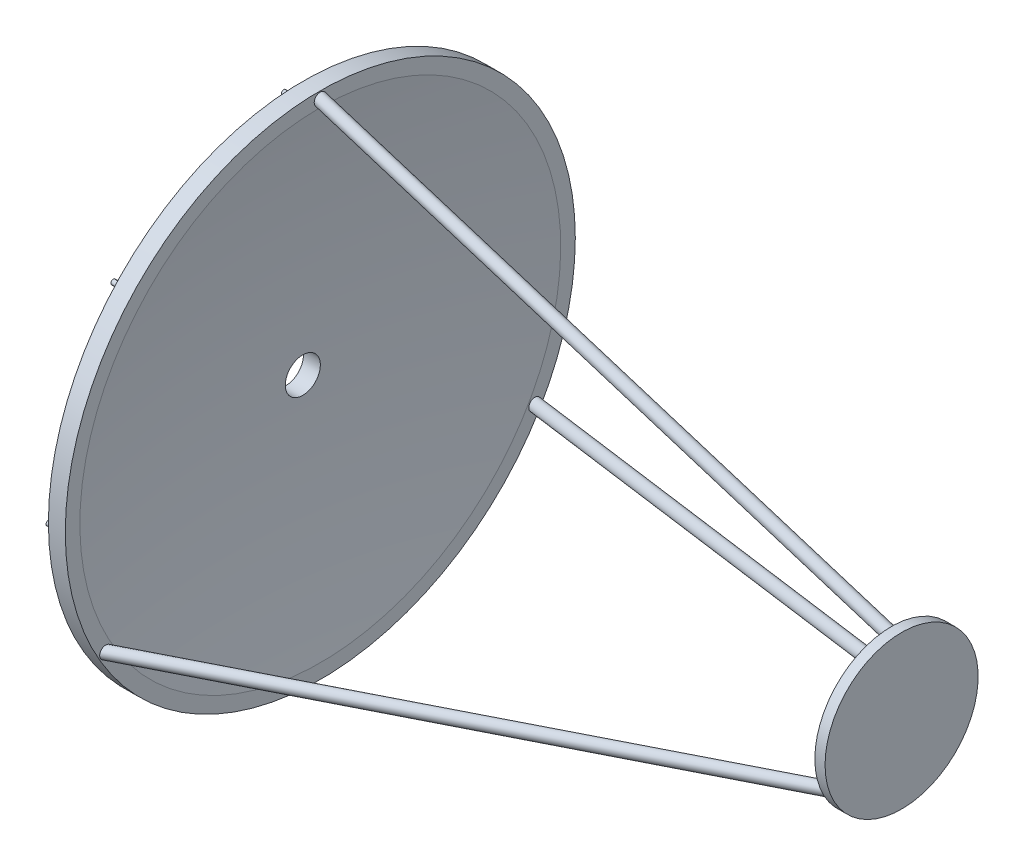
ISO-10303-21;
HEADER;
FILE_DESCRIPTION(('STEP AP214'),'2;1');
FILE_NAME('part.step','',(''),(''),'','','');
FILE_SCHEMA(('AUTOMOTIVE_DESIGN { 1 0 10303 214 1 1 1 1 }'));
ENDSEC;
DATA;
#1=APPLICATION_CONTEXT('core data for automotive mechanical design processes');
#2=APPLICATION_PROTOCOL_DEFINITION('international standard','automotive_design',2000,#1);
#3=PRODUCT_CONTEXT('',#1,'mechanical');
#4=PRODUCT('Part','Part','',(#3));
#5=PRODUCT_RELATED_PRODUCT_CATEGORY('part','',(#4));
#6=PRODUCT_DEFINITION_FORMATION('','',#4);
#7=PRODUCT_DEFINITION_CONTEXT('part definition',#1,'design');
#8=PRODUCT_DEFINITION('design','',#6,#7);
#9=PRODUCT_DEFINITION_SHAPE('','',#8);
#10=(LENGTH_UNIT() NAMED_UNIT(*) SI_UNIT(.MILLI.,.METRE.));
#11=(NAMED_UNIT(*) PLANE_ANGLE_UNIT() SI_UNIT($,.RADIAN.));
#12=(NAMED_UNIT(*) SI_UNIT($,.STERADIAN.) SOLID_ANGLE_UNIT());
#13=UNCERTAINTY_MEASURE_WITH_UNIT(LENGTH_MEASURE(1.E-05),#10,'distance_accuracy_value','');
#14=(GEOMETRIC_REPRESENTATION_CONTEXT(3) GLOBAL_UNCERTAINTY_ASSIGNED_CONTEXT((#13)) GLOBAL_UNIT_ASSIGNED_CONTEXT((#10,
#11,#12)) REPRESENTATION_CONTEXT('',''));
#15=CARTESIAN_POINT('',(0.,0.,0.));
#16=DIRECTION('',(0.,0.,1.));
#17=DIRECTION('',(1.,0.,0.));
#18=AXIS2_PLACEMENT_3D('',#15,#16,#17);
#19=CARTESIAN_POINT('',(464.23266125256,494.679567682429,-5.18085286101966E-13));
#20=DIRECTION('',(-1.,0.,0.));
#21=DIRECTION('',(0.,1.,0.));
#22=AXIS2_PLACEMENT_3D('',#19,#20,#21);
#23=SPHERICAL_SURFACE('',#22,374.);
#24=CARTESIAN_POINT('',(90.2537193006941,494.679567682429,-5.01866450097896E-13));
#25=DIRECTION('',(1.,0.,0.));
#26=DIRECTION('',(0.,0.,-1.));
#27=AXIS2_PLACEMENT_3D('',#24,#25,#26);
#28=CIRCLE('',#27,3.96875000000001);
#29=CARTESIAN_POINT('',(90.2537193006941,498.64831768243,-5.18085286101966E-13));
#30=VERTEX_POINT('',#29);
#31=EDGE_CURVE('E171',#30,#30,#28,.T.);
#32=CARTESIAN_POINT('',(94.2123446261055,494.679567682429,-5.18085286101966E-13));
#33=DIRECTION('',(-1.,0.,0.));
#34=DIRECTION('',(0.,0.,1.));
#35=AXIS2_PLACEMENT_3D('',#32,#33,#34);
#36=CIRCLE('',#35,54.4147524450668);
#37=CARTESIAN_POINT('',(94.2123446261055,549.094320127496,-5.18085286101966E-13));
#38=VERTEX_POINT('',#37);
#39=EDGE_CURVE('E105',#38,#38,#36,.T.);
#40=CARTESIAN_POINT('',(90.2537193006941,498.64831768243,-5.18085286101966E-13));
#41=CARTESIAN_POINT('',(90.25931690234,499.175785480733,-5.18085286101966E-13));
#42=CARTESIAN_POINT('',(90.2660304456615,499.703241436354,-5.18085286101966E-13));
#43=CARTESIAN_POINT('',(90.2816892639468,500.758120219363,-5.18085286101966E-13));
#44=CARTESIAN_POINT('',(90.2906345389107,501.28554304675,-5.18085286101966E-13));
#45=CARTESIAN_POINT('',(90.3107566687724,502.340346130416,-5.18085286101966E-13));
#46=CARTESIAN_POINT('',(90.3219335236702,502.867726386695,-5.18085286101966E-13));
#47=CARTESIAN_POINT('',(90.3465186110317,503.922434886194,-5.18085286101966E-13));
#48=CARTESIAN_POINT('',(90.3599268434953,504.449763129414,-5.18085286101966E-13));
#49=CARTESIAN_POINT('',(90.3889744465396,505.504358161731,-5.18085286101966E-13));
#50=CARTESIAN_POINT('',(90.4046138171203,506.031624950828,-5.18085286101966E-13));
#51=CARTESIAN_POINT('',(90.4381234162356,507.086087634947,-5.18085286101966E-13));
#52=CARTESIAN_POINT('',(90.4559936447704,507.613283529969,-5.18085286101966E-13));
#53=CARTESIAN_POINT('',(90.4939646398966,508.667594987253,-5.18085286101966E-13));
#54=CARTESIAN_POINT('',(90.5140654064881,509.194710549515,-5.18085286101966E-13));
#55=CARTESIAN_POINT('',(90.5564971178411,510.248851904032,-5.18085286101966E-13));
#56=CARTESIAN_POINT('',(90.5788280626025,510.775877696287,-5.18085286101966E-13));
#57=CARTESIAN_POINT('',(90.6257197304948,511.829830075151,-5.18085286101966E-13));
#58=CARTESIAN_POINT('',(90.6502804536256,512.35675666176,-5.18085286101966E-13));
#59=CARTESIAN_POINT('',(90.7016312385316,513.410501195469,-5.18085286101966E-13));
#60=CARTESIAN_POINT('',(90.7284213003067,513.937319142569,-5.18085286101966E-13));
#61=CARTESIAN_POINT('',(90.7842302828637,514.99083696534,-5.18085286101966E-13));
#62=CARTESIAN_POINT('',(90.8132492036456,515.517536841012,-5.18085286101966E-13));
#63=CARTESIAN_POINT('',(90.8735153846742,516.570809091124,-5.18085286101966E-13));
#64=CARTESIAN_POINT('',(90.9047626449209,517.097381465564,-5.18085286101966E-13));
#65=CARTESIAN_POINT('',(90.9694849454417,518.15038928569,-5.18085286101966E-13));
#66=CARTESIAN_POINT('',(91.0029599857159,518.676824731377,-5.18085286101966E-13));
#67=CARTESIAN_POINT('',(91.0721372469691,519.729549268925,-5.18085286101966E-13));
#68=CARTESIAN_POINT('',(91.1078394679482,520.255838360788,-5.18085286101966E-13));
#69=CARTESIAN_POINT('',(91.1814704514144,521.308260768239,-5.18085286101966E-13));
#70=CARTESIAN_POINT('',(91.2193992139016,521.834394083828,-5.18085286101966E-13));
#71=CARTESIAN_POINT('',(91.2974826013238,522.88649551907,-5.18085286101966E-13));
#72=CARTESIAN_POINT('',(91.3376372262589,523.412463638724,-5.18085286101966E-13));
#73=CARTESIAN_POINT('',(91.4201716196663,524.464225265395,-5.18085286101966E-13));
#74=CARTESIAN_POINT('',(91.4625513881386,524.990018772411,-5.18085286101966E-13));
#75=CARTESIAN_POINT('',(91.5495353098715,526.041421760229,-5.18085286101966E-13));
#76=CARTESIAN_POINT('',(91.5941394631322,526.56703124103,-5.18085286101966E-13));
#77=CARTESIAN_POINT('',(91.6855713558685,527.618056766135,-5.18085286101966E-13));
#78=CARTESIAN_POINT('',(91.7323990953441,528.143472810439,-5.18085286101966E-13));
#79=CARTESIAN_POINT('',(91.8282773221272,529.194102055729,-5.18085286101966E-13));
#80=CARTESIAN_POINT('',(91.8773278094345,529.719315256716,-5.18085286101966E-13));
#81=CARTESIAN_POINT('',(91.9776506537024,530.769529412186,-5.18085286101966E-13));
#82=CARTESIAN_POINT('',(92.0289230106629,531.294530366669,-5.18085286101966E-13));
#83=CARTESIAN_POINT('',(92.1336886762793,532.344310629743,-5.18085286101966E-13));
#84=CARTESIAN_POINT('',(92.1871819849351,532.869089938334,-5.18085286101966E-13));
#85=CARTESIAN_POINT('',(92.2963885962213,533.918417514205,-5.18085286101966E-13));
#86=CARTESIAN_POINT('',(92.3521018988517,534.442965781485,-5.18085286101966E-13));
#87=CARTESIAN_POINT('',(92.4657475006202,535.49182188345,-5.18085286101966E-13));
#88=CARTESIAN_POINT('',(92.5236797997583,536.016129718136,-5.18085286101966E-13));
#89=CARTESIAN_POINT('',(92.6417623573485,537.064495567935,-5.18085286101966E-13));
#90=CARTESIAN_POINT('',(92.7019126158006,537.588553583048,-5.18085286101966E-13));
#91=CARTESIAN_POINT('',(92.8244300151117,538.636410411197,-5.18085286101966E-13));
#92=CARTESIAN_POINT('',(92.8867971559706,539.160209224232,-5.18085286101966E-13));
#93=CARTESIAN_POINT('',(93.0137472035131,540.207538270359,-5.18085286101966E-13));
#94=CARTESIAN_POINT('',(93.0783301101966,540.73106850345,-5.18085286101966E-13));
#95=CARTESIAN_POINT('',(93.2097105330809,541.777851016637,-5.18085286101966E-13));
#96=CARTESIAN_POINT('',(93.2765080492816,542.301103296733,-5.18085286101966E-13));
#97=CARTESIAN_POINT('',(93.4123164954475,543.347320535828,-5.18085286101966E-13));
#98=CARTESIAN_POINT('',(93.4813274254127,543.870285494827,-5.18085286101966E-13));
#99=CARTESIAN_POINT('',(93.621561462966,544.915918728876,-5.18085286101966E-13));
#100=CARTESIAN_POINT('',(93.6927845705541,545.438587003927,-5.18085286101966E-13));
#101=CARTESIAN_POINT('',(93.8374416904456,546.483617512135,-5.18085286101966E-13));
#102=CARTESIAN_POINT('',(93.910875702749,547.005979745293,-5.18085286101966E-13));
#103=CARTESIAN_POINT('',(94.059953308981,548.050388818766,-5.18085286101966E-13));
#104=CARTESIAN_POINT('',(94.1355969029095,548.57243565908,-5.18085286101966E-13));
#105=CARTESIAN_POINT('',(94.2123446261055,549.094320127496,-5.18085286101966E-13));
#106=B_SPLINE_CURVE_WITH_KNOTS('',3,(#40,#41,#42,#43,#44,#45,#46,#47,#48,#49,#50,#51,#52,#53,
#54,#55,#56,#57,#58,#59,#60,#61,#62,#63,#64,#65,#66,#67,#68,#69,#70,#71,#72,#73,#74,#75,#76,#77,
#78,#79,#80,#81,#82,#83,#84,#85,#86,#87,#88,#89,#90,#91,#92,#93,#94,#95,#96,#97,#98,#99,#100,
#101,#102,#103,#104,#105),.UNSPECIFIED.,.F.,.F.,(4,2,2,2,2,2,2,2,2,2,2,2,2,2,2,2,2,2,2,2,2,2,2,
2,2,2,2,2,2,2,2,2,4),(0.,1.58249131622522,3.16498263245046,4.74747394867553,6.32996526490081,
7.91245658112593,9.49494789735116,11.0774392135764,12.6599305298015,14.2424218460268,
15.824913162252,17.4074044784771,18.9898957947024,20.5723871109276,22.1548784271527,
23.7373697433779,25.3198610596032,26.9023523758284,28.4848436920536,30.0673350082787,
31.6498263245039,33.2323176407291,34.8148089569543,36.3973002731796,37.9797915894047,
39.5622829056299,41.1447742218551,42.7272655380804,44.3097568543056,45.8922481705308,
47.4747394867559,49.0572308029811,50.6397221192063),.UNSPECIFIED.);
#107=EDGE_CURVE('BSEAM47',#30,#38,#106,.T.);
#108=ORIENTED_EDGE('',*,*,#31,.F.);
#109=ORIENTED_EDGE('',*,*,#39,.F.);
#110=ORIENTED_EDGE('',*,*,#107,.T.);
#111=ORIENTED_EDGE('',*,*,#107,.F.);
#112=EDGE_LOOP('',(#108,#110,#109,#111));
#113=FACE_BOUND('',#112,.T.);
#114=ADVANCED_FACE('F47',(#113),#23,.F.);
#115=CARTESIAN_POINT('',(460.409347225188,494.679567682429,-5.18085286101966E-13));
#116=DIRECTION('',(-1.,0.,0.));
#117=DIRECTION('',(0.,1.,0.));
#118=AXIS2_PLACEMENT_3D('',#115,#116,#117);
#119=SPHERICAL_SURFACE('',#118,374.);
#120=CARTESIAN_POINT('',(86.4304052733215,494.679567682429,-5.01866450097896E-13));
#121=DIRECTION('',(1.,0.,0.));
#122=DIRECTION('',(0.,0.,-1.));
#123=AXIS2_PLACEMENT_3D('',#120,#121,#122);
#124=CIRCLE('',#123,3.96875000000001);
#125=CARTESIAN_POINT('',(86.4304052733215,498.64831768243,-5.18085286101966E-13));
#126=VERTEX_POINT('',#125);
#127=EDGE_CURVE('E51',#126,#126,#124,.T.);
#128=CARTESIAN_POINT('',(90.3890305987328,494.679567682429,-5.18085286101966E-13));
#129=DIRECTION('',(-1.,0.,0.));
#130=DIRECTION('',(0.,0.,1.));
#131=AXIS2_PLACEMENT_3D('',#128,#129,#130);
#132=CIRCLE('',#131,54.4147524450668);
#133=CARTESIAN_POINT('',(90.3890305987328,549.094320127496,-5.18085286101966E-13));
#134=VERTEX_POINT('',#133);
#135=EDGE_CURVE('E121',#134,#134,#132,.T.);
#136=CARTESIAN_POINT('',(86.4304052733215,498.64831768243,-5.18085286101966E-13));
#137=CARTESIAN_POINT('',(86.4360028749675,499.175785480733,-5.18085286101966E-13));
#138=CARTESIAN_POINT('',(86.4427164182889,499.703241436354,-5.18085286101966E-13));
#139=CARTESIAN_POINT('',(86.4583752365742,500.758120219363,-5.18085286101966E-13));
#140=CARTESIAN_POINT('',(86.4673205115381,501.285543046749,-5.18085286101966E-13));
#141=CARTESIAN_POINT('',(86.4874426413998,502.340346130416,-5.18085286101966E-13));
#142=CARTESIAN_POINT('',(86.4986194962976,502.867726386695,-5.18085286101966E-13));
#143=CARTESIAN_POINT('',(86.5232045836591,503.922434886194,-5.18085286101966E-13));
#144=CARTESIAN_POINT('',(86.5366128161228,504.449763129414,-5.18085286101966E-13));
#145=CARTESIAN_POINT('',(86.565660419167,505.504358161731,-5.18085286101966E-13));
#146=CARTESIAN_POINT('',(86.5812997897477,506.031624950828,-5.18085286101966E-13));
#147=CARTESIAN_POINT('',(86.614809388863,507.086087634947,-5.18085286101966E-13));
#148=CARTESIAN_POINT('',(86.6326796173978,507.613283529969,-5.18085286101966E-13));
#149=CARTESIAN_POINT('',(86.670650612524,508.667594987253,-5.18085286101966E-13));
#150=CARTESIAN_POINT('',(86.6907513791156,509.194710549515,-5.18085286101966E-13));
#151=CARTESIAN_POINT('',(86.7331830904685,510.248851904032,-5.18085286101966E-13));
#152=CARTESIAN_POINT('',(86.7555140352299,510.775877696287,-5.18085286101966E-13));
#153=CARTESIAN_POINT('',(86.8024057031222,511.829830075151,-5.18085286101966E-13));
#154=CARTESIAN_POINT('',(86.826966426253,512.35675666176,-5.18085286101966E-13));
#155=CARTESIAN_POINT('',(86.878317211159,513.410501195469,-5.18085286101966E-13));
#156=CARTESIAN_POINT('',(86.9051072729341,513.937319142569,-5.18085286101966E-13));
#157=CARTESIAN_POINT('',(86.9609162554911,514.99083696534,-5.18085286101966E-13));
#158=CARTESIAN_POINT('',(86.989935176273,515.517536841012,-5.18085286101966E-13));
#159=CARTESIAN_POINT('',(87.0502013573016,516.570809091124,-5.18085286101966E-13));
#160=CARTESIAN_POINT('',(87.0814486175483,517.097381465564,-5.18085286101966E-13));
#161=CARTESIAN_POINT('',(87.1461709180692,518.15038928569,-5.18085286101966E-13));
#162=CARTESIAN_POINT('',(87.1796459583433,518.676824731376,-5.18085286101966E-13));
#163=CARTESIAN_POINT('',(87.2488232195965,519.729549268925,-5.18085286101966E-13));
#164=CARTESIAN_POINT('',(87.2845254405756,520.255838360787,-5.18085286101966E-13));
#165=CARTESIAN_POINT('',(87.3581564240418,521.308260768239,-5.18085286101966E-13));
#166=CARTESIAN_POINT('',(87.3960851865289,521.834394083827,-5.18085286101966E-13));
#167=CARTESIAN_POINT('',(87.4741685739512,522.88649551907,-5.18085286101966E-13));
#168=CARTESIAN_POINT('',(87.5143231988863,523.412463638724,-5.18085286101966E-13));
#169=CARTESIAN_POINT('',(87.5968575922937,524.464225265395,-5.18085286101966E-13));
#170=CARTESIAN_POINT('',(87.6392373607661,524.990018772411,-5.18085286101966E-13));
#171=CARTESIAN_POINT('',(87.726221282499,526.041421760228,-5.18085286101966E-13));
#172=CARTESIAN_POINT('',(87.7708254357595,526.56703124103,-5.18085286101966E-13));
#173=CARTESIAN_POINT('',(87.8622573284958,527.618056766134,-5.18085286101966E-13));
#174=CARTESIAN_POINT('',(87.9090850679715,528.143472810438,-5.18085286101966E-13));
#175=CARTESIAN_POINT('',(88.0049632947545,529.194102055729,-5.18085286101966E-13));
#176=CARTESIAN_POINT('',(88.0540137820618,529.719315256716,-5.18085286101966E-13));
#177=CARTESIAN_POINT('',(88.1543366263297,530.769529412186,-5.18085286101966E-13));
#178=CARTESIAN_POINT('',(88.2056089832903,531.294530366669,-5.18085286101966E-13));
#179=CARTESIAN_POINT('',(88.3103746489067,532.344310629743,-5.18085286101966E-13));
#180=CARTESIAN_POINT('',(88.3638679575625,532.869089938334,-5.18085286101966E-13));
#181=CARTESIAN_POINT('',(88.4730745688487,533.918417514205,-5.18085286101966E-13));
#182=CARTESIAN_POINT('',(88.5287878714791,534.442965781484,-5.18085286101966E-13));
#183=CARTESIAN_POINT('',(88.6424334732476,535.49182188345,-5.18085286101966E-13));
#184=CARTESIAN_POINT('',(88.7003657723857,536.016129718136,-5.18085286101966E-13));
#185=CARTESIAN_POINT('',(88.8184483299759,537.064495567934,-5.18085286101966E-13));
#186=CARTESIAN_POINT('',(88.8785985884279,537.588553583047,-5.18085286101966E-13));
#187=CARTESIAN_POINT('',(89.001115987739,538.636410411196,-5.18085286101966E-13));
#188=CARTESIAN_POINT('',(89.063483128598,539.160209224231,-5.18085286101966E-13));
#189=CARTESIAN_POINT('',(89.1904331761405,540.207538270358,-5.18085286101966E-13));
#190=CARTESIAN_POINT('',(89.255016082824,540.731068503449,-5.18085286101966E-13));
#191=CARTESIAN_POINT('',(89.3863965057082,541.777851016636,-5.18085286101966E-13));
#192=CARTESIAN_POINT('',(89.4531940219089,542.301103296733,-5.18085286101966E-13));
#193=CARTESIAN_POINT('',(89.5890024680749,543.347320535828,-5.18085286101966E-13));
#194=CARTESIAN_POINT('',(89.6580133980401,543.870285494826,-5.18085286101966E-13));
#195=CARTESIAN_POINT('',(89.7982474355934,544.915918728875,-5.18085286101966E-13));
#196=CARTESIAN_POINT('',(89.8694705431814,545.438587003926,-5.18085286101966E-13));
#197=CARTESIAN_POINT('',(90.0141276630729,546.483617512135,-5.18085286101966E-13));
#198=CARTESIAN_POINT('',(90.0875616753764,547.005979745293,-5.18085286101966E-13));
#199=CARTESIAN_POINT('',(90.2366392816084,548.050388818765,-5.18085286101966E-13));
#200=CARTESIAN_POINT('',(90.3122828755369,548.572435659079,-5.18085286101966E-13));
#201=CARTESIAN_POINT('',(90.3890305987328,549.094320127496,-5.18085286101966E-13));
#202=B_SPLINE_CURVE_WITH_KNOTS('',3,(#136,#137,#138,#139,#140,#141,#142,#143,#144,#145,#146,
#147,#148,#149,#150,#151,#152,#153,#154,#155,#156,#157,#158,#159,#160,#161,#162,#163,#164,#165,
#166,#167,#168,#169,#170,#171,#172,#173,#174,#175,#176,#177,#178,#179,#180,#181,#182,#183,#184,
#185,#186,#187,#188,#189,#190,#191,#192,#193,#194,#195,#196,#197,#198,#199,#200,#201),
.UNSPECIFIED.,.F.,.F.,(4,2,2,2,2,2,2,2,2,2,2,2,2,2,2,2,2,2,2,2,2,2,2,2,2,2,2,2,2,2,2,2,4),(0.,
1.58249131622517,3.1649826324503,4.74747394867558,6.32996526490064,7.91245658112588,
9.49494789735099,11.0774392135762,12.6599305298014,14.2424218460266,15.8249131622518,
17.4074044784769,18.9898957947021,20.5723871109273,22.1548784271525,23.7373697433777,
25.3198610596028,26.902352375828,28.4848436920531,30.0673350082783,31.6498263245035,
33.2323176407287,34.8148089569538,36.3973002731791,37.9797915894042,39.5622829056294,
41.1447742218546,42.7272655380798,44.309756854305,45.8922481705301,47.4747394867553,
49.0572308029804,50.6397221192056),.UNSPECIFIED.);
#203=EDGE_CURVE('BSEAM180',#126,#134,#202,.T.);
#204=ORIENTED_EDGE('',*,*,#127,.T.);
#205=ORIENTED_EDGE('',*,*,#135,.T.);
#206=ORIENTED_EDGE('',*,*,#203,.T.);
#207=ORIENTED_EDGE('',*,*,#203,.F.);
#208=EDGE_LOOP('',(#204,#206,#205,#207));
#209=FACE_BOUND('',#208,.T.);
#210=ADVANCED_FACE('F180',(#209),#119,.T.);
#211=CARTESIAN_POINT('',(90.3890305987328,494.679567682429,-5.18085286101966E-13));
#212=DIRECTION('',(-1.,0.,0.));
#213=DIRECTION('',(0.,0.,1.));
#214=AXIS2_PLACEMENT_3D('',#211,#212,#213);
#215=CYLINDRICAL_SURFACE('',#214,17.3248173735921);
#216=CARTESIAN_POINT('',(223.459602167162,494.679567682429,-5.18085286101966E-13));
#217=DIRECTION('',(-1.,0.,0.));
#218=DIRECTION('',(0.,0.,1.));
#219=AXIS2_PLACEMENT_3D('',#216,#217,#218);
#220=CIRCLE('',#219,17.3248173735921);
#221=CARTESIAN_POINT('',(223.459602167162,494.679567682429,17.3248173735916));
#222=VERTEX_POINT('',#221);
#223=EDGE_CURVE('E88',#222,#222,#220,.T.);
#224=ORIENTED_EDGE('',*,*,#223,.F.);
#225=EDGE_LOOP('',(#224));
#226=FACE_BOUND('',#225,.T.);
#227=CARTESIAN_POINT('',(225.770787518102,494.679567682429,-5.18085286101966E-13));
#228=DIRECTION('',(-1.,0.,0.));
#229=DIRECTION('',(0.,0.,1.));
#230=AXIS2_PLACEMENT_3D('',#227,#228,#229);
#231=CIRCLE('',#230,17.3248173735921);
#232=CARTESIAN_POINT('',(225.770787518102,494.679567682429,17.3248173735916));
#233=VERTEX_POINT('',#232);
#234=EDGE_CURVE('E97',#233,#233,#231,.T.);
#235=ORIENTED_EDGE('',*,*,#234,.T.);
#236=EDGE_LOOP('',(#235));
#237=FACE_BOUND('',#236,.T.);
#238=ADVANCED_FACE('F49',(#226,#237),#215,.T.);
#239=CARTESIAN_POINT('',(223.459602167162,440.264815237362,-5.18085286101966E-13));
#240=DIRECTION('',(1.,0.,0.));
#241=DIRECTION('',(0.,0.,-1.));
#242=AXIS2_PLACEMENT_3D('',#239,#240,#241);
#243=PLANE('',#242);
#244=CARTESIAN_POINT('',(223.459602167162,486.842158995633,13.574790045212));
#245=DIRECTION('',(-1.,0.,0.));
#246=DIRECTION('',(0.,-0.866025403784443,-0.499999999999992));
#247=AXIS2_PLACEMENT_3D('',#244,#245,#246);
#248=CIRCLE('',#247,1.375);
#249=CARTESIAN_POINT('',(223.459602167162,485.65137406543,12.887290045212));
#250=VERTEX_POINT('',#249);
#251=EDGE_CURVE('E87',#250,#250,#248,.T.);
#252=ORIENTED_EDGE('',*,*,#251,.F.);
#253=EDGE_LOOP('',(#252));
#254=FACE_BOUND('',#253,.T.);
#255=CARTESIAN_POINT('',(223.459602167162,486.842158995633,-13.5747900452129));
#256=DIRECTION('',(-1.,0.,0.));
#257=DIRECTION('',(0.,0.866025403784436,-0.500000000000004));
#258=AXIS2_PLACEMENT_3D('',#255,#256,#257);
#259=CIRCLE('',#258,1.375);
#260=CARTESIAN_POINT('',(223.459602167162,488.032943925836,-14.2622900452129));
#261=VERTEX_POINT('',#260);
#262=EDGE_CURVE('E109',#261,#261,#259,.T.);
#263=ORIENTED_EDGE('',*,*,#262,.F.);
#264=EDGE_LOOP('',(#263));
#265=FACE_BOUND('',#264,.T.);
#266=CARTESIAN_POINT('',(223.459602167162,510.354385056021,-5.18085286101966E-13));
#267=DIRECTION('',(-1.,0.,0.));
#268=DIRECTION('',(0.,0.,1.));
#269=AXIS2_PLACEMENT_3D('',#266,#267,#268);
#270=CIRCLE('',#269,1.375);
#271=CARTESIAN_POINT('',(223.459602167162,510.354385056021,1.37499999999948));
#272=VERTEX_POINT('',#271);
#273=EDGE_CURVE('E92',#272,#272,#270,.T.);
#274=ORIENTED_EDGE('',*,*,#273,.F.);
#275=EDGE_LOOP('',(#274));
#276=FACE_BOUND('',#275,.T.);
#277=CARTESIAN_POINT('',(223.459602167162,494.679567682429,-5.18085286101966E-13));
#278=DIRECTION('',(-1.,0.,0.));
#279=DIRECTION('',(0.,0.,1.));
#280=AXIS2_PLACEMENT_3D('',#277,#278,#279);
#281=CIRCLE('',#280,14.0248173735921);
#282=CARTESIAN_POINT('',(223.459602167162,494.679567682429,14.0248173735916));
#283=VERTEX_POINT('',#282);
#284=EDGE_CURVE('E93',#283,#283,#281,.T.);
#285=ORIENTED_EDGE('',*,*,#284,.F.);
#286=EDGE_LOOP('',(#285));
#287=FACE_BOUND('',#286,.T.);
#288=ORIENTED_EDGE('',*,*,#223,.T.);
#289=EDGE_LOOP('',(#288));
#290=FACE_BOUND('',#289,.T.);
#291=ADVANCED_FACE('F222',(#254,#265,#276,#287,#290),#243,.F.);
#292=CARTESIAN_POINT('',(314.789030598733,494.679567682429,-5.18085286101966E-13));
#293=DIRECTION('',(-1.,0.,0.));
#294=DIRECTION('',(0.,1.,0.));
#295=AXIS2_PLACEMENT_3D('',#292,#293,#294);
#296=SPHERICAL_SURFACE('',#295,92.4);
#297=ORIENTED_EDGE('',*,*,#284,.T.);
#298=EDGE_LOOP('',(#297));
#299=FACE_BOUND('',#298,.T.);
#300=ADVANCED_FACE('F219',(#299),#296,.T.);
#301=CARTESIAN_POINT('',(225.770787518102,440.264815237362,-5.18085286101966E-13));
#302=DIRECTION('',(-1.,0.,0.));
#303=DIRECTION('',(0.,0.,1.));
#304=AXIS2_PLACEMENT_3D('',#301,#302,#303);
#305=PLANE('',#304);
#306=ORIENTED_EDGE('',*,*,#234,.F.);
#307=EDGE_LOOP('',(#306));
#308=FACE_BOUND('',#307,.T.);
#309=ADVANCED_FACE('F210',(#308),#305,.F.);
#310=CARTESIAN_POINT('',(223.459602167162,510.354385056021,1.37499999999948));
#311=CARTESIAN_POINT('',(94.2123446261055,550.744320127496,1.37499999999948));
#312=CARTESIAN_POINT('',(223.459602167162,513.104385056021,1.37499999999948));
#313=CARTESIAN_POINT('',(94.2123446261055,553.494320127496,1.37499999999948));
#314=CARTESIAN_POINT('',(223.459602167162,513.104385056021,-1.37500000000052));
#315=CARTESIAN_POINT('',(94.2123446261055,553.494320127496,-1.37500000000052));
#316=CARTESIAN_POINT('',(223.459602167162,510.354385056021,-1.37500000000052));
#317=CARTESIAN_POINT('',(94.2123446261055,550.744320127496,-1.37500000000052));
#318=CARTESIAN_POINT('',(223.459602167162,507.604385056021,-1.37500000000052));
#319=CARTESIAN_POINT('',(94.2123446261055,547.994320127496,-1.37500000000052));
#320=CARTESIAN_POINT('',(223.459602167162,507.604385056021,1.37499999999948));
#321=CARTESIAN_POINT('',(94.2123446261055,547.994320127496,1.37499999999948));
#322=CARTESIAN_POINT('',(223.459602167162,510.354385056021,1.37499999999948));
#323=CARTESIAN_POINT('',(94.2123446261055,550.744320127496,1.37499999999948));
#324=(BOUNDED_SURFACE() B_SPLINE_SURFACE(3,1,((#310,#311),(#312,#313),(#314,#315),(#316,#317),
(#318,#319),(#320,#321),(#322,#323)),.UNSPECIFIED.,.T.,.F.,.F.) B_SPLINE_SURFACE_WITH_KNOTS((4,
3,4),(2,2),(0.,0.5,1.),(0.,1.),
.UNSPECIFIED.) GEOMETRIC_REPRESENTATION_ITEM() RATIONAL_B_SPLINE_SURFACE(((1.,1.),
(0.333333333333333,0.333333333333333),(0.333333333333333,0.333333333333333),(1.,1.),
(0.333333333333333,0.333333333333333),(0.333333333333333,0.333333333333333),(1.,1.))) REPRESENTATION_ITEM('') SURFACE());
#325=CARTESIAN_POINT('',(94.2123446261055,550.744320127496,-5.18085286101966E-13));
#326=DIRECTION('',(-1.,0.,0.));
#327=DIRECTION('',(0.,0.,1.));
#328=AXIS2_PLACEMENT_3D('',#325,#326,#327);
#329=CIRCLE('',#328,1.375);
#330=CARTESIAN_POINT('',(94.2123446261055,550.744320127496,1.37499999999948));
#331=VERTEX_POINT('',#330);
#332=EDGE_CURVE('E101',#331,#331,#329,.T.);
#333=CARTESIAN_POINT('',(94.2123446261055,550.744320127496,1.37499999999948));
#334=CARTESIAN_POINT('',(95.5586702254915,550.323591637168,1.37499999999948));
#335=CARTESIAN_POINT('',(96.9049958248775,549.90286314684,1.37499999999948));
#336=CARTESIAN_POINT('',(99.5976470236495,549.061406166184,1.37499999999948));
#337=CARTESIAN_POINT('',(100.943972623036,548.640677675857,1.37499999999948));
#338=CARTESIAN_POINT('',(103.636623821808,547.799220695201,1.37499999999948));
#339=CARTESIAN_POINT('',(104.982949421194,547.378492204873,1.37499999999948));
#340=CARTESIAN_POINT('',(107.675600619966,546.537035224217,1.37499999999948));
#341=CARTESIAN_POINT('',(109.021926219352,546.116306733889,1.37499999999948));
#342=CARTESIAN_POINT('',(111.714577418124,545.274849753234,1.37499999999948));
#343=CARTESIAN_POINT('',(113.06090301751,544.854121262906,1.37499999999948));
#344=CARTESIAN_POINT('',(115.753554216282,544.01266428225,1.37499999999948));
#345=CARTESIAN_POINT('',(117.099879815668,543.591935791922,1.37499999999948));
#346=CARTESIAN_POINT('',(119.79253101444,542.750478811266,1.37499999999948));
#347=CARTESIAN_POINT('',(121.138856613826,542.329750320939,1.37499999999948));
#348=CARTESIAN_POINT('',(123.831507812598,541.488293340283,1.37499999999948));
#349=CARTESIAN_POINT('',(125.177833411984,541.067564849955,1.37499999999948));
#350=CARTESIAN_POINT('',(127.870484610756,540.226107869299,1.37499999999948));
#351=CARTESIAN_POINT('',(129.216810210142,539.805379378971,1.37499999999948));
#352=CARTESIAN_POINT('',(131.909461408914,538.963922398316,1.37499999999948));
#353=CARTESIAN_POINT('',(133.2557870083,538.543193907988,1.37499999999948));
#354=CARTESIAN_POINT('',(135.948438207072,537.701736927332,1.37499999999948));
#355=CARTESIAN_POINT('',(137.294763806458,537.281008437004,1.37499999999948));
#356=CARTESIAN_POINT('',(139.98741500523,536.439551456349,1.37499999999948));
#357=CARTESIAN_POINT('',(141.333740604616,536.018822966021,1.37499999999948));
#358=CARTESIAN_POINT('',(144.026391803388,535.177365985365,1.37499999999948));
#359=CARTESIAN_POINT('',(145.372717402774,534.756637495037,1.37499999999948));
#360=CARTESIAN_POINT('',(148.065368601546,533.915180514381,1.37499999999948));
#361=CARTESIAN_POINT('',(149.411694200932,533.494452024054,1.37499999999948));
#362=CARTESIAN_POINT('',(152.104345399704,532.652995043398,1.37499999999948));
#363=CARTESIAN_POINT('',(153.45067099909,532.23226655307,1.37499999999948));
#364=CARTESIAN_POINT('',(156.143322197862,531.390809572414,1.37499999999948));
#365=CARTESIAN_POINT('',(157.489647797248,530.970081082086,1.37499999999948));
#366=CARTESIAN_POINT('',(160.18229899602,530.12862410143,1.37499999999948));
#367=CARTESIAN_POINT('',(161.528624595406,529.707895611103,1.37499999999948));
#368=CARTESIAN_POINT('',(164.221275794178,528.866438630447,1.37499999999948));
#369=CARTESIAN_POINT('',(165.567601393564,528.445710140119,1.37499999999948));
#370=CARTESIAN_POINT('',(168.260252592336,527.604253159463,1.37499999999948));
#371=CARTESIAN_POINT('',(169.606578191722,527.183524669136,1.37499999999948));
#372=CARTESIAN_POINT('',(172.299229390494,526.34206768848,1.37499999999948));
#373=CARTESIAN_POINT('',(173.64555498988,525.921339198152,1.37499999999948));
#374=CARTESIAN_POINT('',(176.338206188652,525.079882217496,1.37499999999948));
#375=CARTESIAN_POINT('',(177.684531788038,524.659153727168,1.37499999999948));
#376=CARTESIAN_POINT('',(180.37718298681,523.817696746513,1.37499999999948));
#377=CARTESIAN_POINT('',(181.723508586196,523.396968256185,1.37499999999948));
#378=CARTESIAN_POINT('',(184.416159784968,522.555511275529,1.37499999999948));
#379=CARTESIAN_POINT('',(185.762485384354,522.134782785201,1.37499999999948));
#380=CARTESIAN_POINT('',(188.455136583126,521.293325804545,1.37499999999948));
#381=CARTESIAN_POINT('',(189.801462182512,520.872597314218,1.37499999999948));
#382=CARTESIAN_POINT('',(192.494113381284,520.031140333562,1.37499999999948));
#383=CARTESIAN_POINT('',(193.84043898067,519.610411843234,1.37499999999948));
#384=CARTESIAN_POINT('',(196.533090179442,518.768954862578,1.37499999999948));
#385=CARTESIAN_POINT('',(197.879415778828,518.348226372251,1.37499999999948));
#386=CARTESIAN_POINT('',(200.5720669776,517.506769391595,1.37499999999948));
#387=CARTESIAN_POINT('',(201.918392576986,517.086040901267,1.37499999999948));
#388=CARTESIAN_POINT('',(204.611043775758,516.244583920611,1.37499999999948));
#389=CARTESIAN_POINT('',(205.957369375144,515.823855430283,1.37499999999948));
#390=CARTESIAN_POINT('',(208.650020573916,514.982398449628,1.37499999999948));
#391=CARTESIAN_POINT('',(209.996346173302,514.5616699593,1.37499999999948));
#392=CARTESIAN_POINT('',(212.688997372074,513.720212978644,1.37499999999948));
#393=CARTESIAN_POINT('',(214.03532297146,513.299484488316,1.37499999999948));
#394=CARTESIAN_POINT('',(216.727974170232,512.45802750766,1.37499999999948));
#395=CARTESIAN_POINT('',(218.074299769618,512.037299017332,1.37499999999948));
#396=CARTESIAN_POINT('',(220.76695096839,511.195842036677,1.37499999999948));
#397=CARTESIAN_POINT('',(222.113276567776,510.775113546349,1.37499999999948));
#398=CARTESIAN_POINT('',(223.459602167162,510.354385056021,1.37499999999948));
#399=B_SPLINE_CURVE_WITH_KNOTS('',3,(#333,#334,#335,#336,#337,#338,#339,#340,#341,#342,#343,
#344,#345,#346,#347,#348,#349,#350,#351,#352,#353,#354,#355,#356,#357,#358,#359,#360,#361,#362,
#363,#364,#365,#366,#367,#368,#369,#370,#371,#372,#373,#374,#375,#376,#377,#378,#379,#380,#381,
#382,#383,#384,#385,#386,#387,#388,#389,#390,#391,#392,#393,#394,#395,#396,#397,#398),
.UNSPECIFIED.,.F.,.F.,(4,2,2,2,2,2,2,2,2,2,2,2,2,2,2,2,2,2,2,2,2,2,2,2,2,2,2,2,2,2,2,2,4),(0.,
4.2316008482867,8.46320169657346,12.6948025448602,16.9264033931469,21.1580042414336,
25.3896050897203,29.621205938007,33.8528067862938,38.0844076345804,42.3160084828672,
46.5476093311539,50.7792101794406,55.0108110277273,59.2424118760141,63.4740127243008,
67.7056135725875,71.9372144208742,76.1688152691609,80.4004161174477,84.6320169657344,
88.8636178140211,93.0952186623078,97.3268195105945,101.558420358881,105.790021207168,
110.021622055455,114.253222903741,118.484823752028,122.716424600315,126.948025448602,
131.179626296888,135.411227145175),.UNSPECIFIED.);
#400=EDGE_CURVE('BSEAM205',#331,#272,#399,.T.);
#401=ORIENTED_EDGE('',*,*,#332,.F.);
#402=ORIENTED_EDGE('',*,*,#273,.T.);
#403=ORIENTED_EDGE('',*,*,#400,.T.);
#404=ORIENTED_EDGE('',*,*,#400,.F.);
#405=EDGE_LOOP('',(#401,#403,#402,#404));
#406=FACE_BOUND('',#405,.T.);
#407=ADVANCED_FACE('F205',(#406),#324,.T.);
#408=CARTESIAN_POINT('',(94.2123446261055,440.264815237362,-5.18085286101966E-13));
#409=DIRECTION('',(-1.,0.,0.));
#410=DIRECTION('',(0.,0.,1.));
#411=AXIS2_PLACEMENT_3D('',#408,#409,#410);
#412=PLANE('',#411);
#413=CARTESIAN_POINT('',(94.2123446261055,466.647191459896,48.5534998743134));
#414=DIRECTION('',(-1.,0.,0.));
#415=DIRECTION('',(0.,-0.866025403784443,-0.499999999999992));
#416=AXIS2_PLACEMENT_3D('',#413,#414,#415);
#417=CIRCLE('',#416,1.375);
#418=CARTESIAN_POINT('',(94.2123446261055,465.456406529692,47.8659998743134));
#419=VERTEX_POINT('',#418);
#420=EDGE_CURVE('E129',#419,#419,#417,.T.);
#421=ORIENTED_EDGE('',*,*,#420,.T.);
#422=EDGE_LOOP('',(#421));
#423=FACE_BOUND('',#422,.T.);
#424=CARTESIAN_POINT('',(94.2123446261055,466.647191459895,-48.5534998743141));
#425=DIRECTION('',(-1.,0.,0.));
#426=DIRECTION('',(0.,0.866025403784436,-0.500000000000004));
#427=AXIS2_PLACEMENT_3D('',#424,#425,#426);
#428=CIRCLE('',#427,1.375);
#429=CARTESIAN_POINT('',(94.2123446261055,467.837976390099,-49.2409998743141));
#430=VERTEX_POINT('',#429);
#431=EDGE_CURVE('E125',#430,#430,#428,.T.);
#432=ORIENTED_EDGE('',*,*,#431,.T.);
#433=EDGE_LOOP('',(#432));
#434=FACE_BOUND('',#433,.T.);
#435=ORIENTED_EDGE('',*,*,#332,.T.);
#436=EDGE_LOOP('',(#435));
#437=FACE_BOUND('',#436,.T.);
#438=CARTESIAN_POINT('',(94.2123446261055,494.679567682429,-5.18085286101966E-13));
#439=DIRECTION('',(-1.,0.,0.));
#440=DIRECTION('',(0.,0.,1.));
#441=AXIS2_PLACEMENT_3D('',#438,#439,#440);
#442=CIRCLE('',#441,57.7147524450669);
#443=CARTESIAN_POINT('',(94.2123446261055,494.679567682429,57.7147524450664));
#444=VERTEX_POINT('',#443);
#445=EDGE_CURVE('E113',#444,#444,#442,.T.);
#446=ORIENTED_EDGE('',*,*,#445,.F.);
#447=EDGE_LOOP('',(#446));
#448=FACE_BOUND('',#447,.T.);
#449=ORIENTED_EDGE('',*,*,#39,.T.);
#450=EDGE_LOOP('',(#449));
#451=FACE_BOUND('',#450,.T.);
#452=ADVANCED_FACE('F203',(#423,#434,#437,#448,#451),#412,.F.);
#453=CARTESIAN_POINT('',(90.3890305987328,494.679567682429,-5.18085286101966E-13));
#454=DIRECTION('',(-1.,0.,0.));
#455=DIRECTION('',(0.,0.,1.));
#456=AXIS2_PLACEMENT_3D('',#453,#454,#455);
#457=CYLINDRICAL_SURFACE('',#456,57.7147524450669);
#458=CARTESIAN_POINT('',(90.3890305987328,494.679567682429,-5.18085286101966E-13));
#459=DIRECTION('',(-1.,0.,0.));
#460=DIRECTION('',(0.,0.,1.));
#461=AXIS2_PLACEMENT_3D('',#458,#459,#460);
#462=CIRCLE('',#461,57.7147524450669);
#463=CARTESIAN_POINT('',(90.3890305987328,494.679567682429,57.7147524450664));
#464=VERTEX_POINT('',#463);
#465=EDGE_CURVE('E117',#464,#464,#462,.T.);
#466=ORIENTED_EDGE('',*,*,#465,.F.);
#467=EDGE_LOOP('',(#466));
#468=FACE_BOUND('',#467,.T.);
#469=ORIENTED_EDGE('',*,*,#445,.T.);
#470=EDGE_LOOP('',(#469));
#471=FACE_BOUND('',#470,.T.);
#472=ADVANCED_FACE('F256',(#468,#471),#457,.T.);
#473=CARTESIAN_POINT('',(90.3890305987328,440.264815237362,-5.18085286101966E-13));
#474=DIRECTION('',(1.,0.,0.));
#475=DIRECTION('',(0.,0.,-1.));
#476=AXIS2_PLACEMENT_3D('',#473,#474,#475);
#477=PLANE('',#476);
#478=CARTESIAN_POINT('',(90.3890305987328,535.519061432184,-37.6555208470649));
#479=DIRECTION('',(1.,0.,0.));
#480=DIRECTION('',(0.,0.,-1.));
#481=AXIS2_PLACEMENT_3D('',#478,#479,#480);
#482=CIRCLE('',#481,0.55);
#483=CARTESIAN_POINT('',(90.3890305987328,535.519061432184,-38.205520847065));
#484=VERTEX_POINT('',#483);
#485=EDGE_CURVE('E10',#484,#484,#482,.F.);
#486=ORIENTED_EDGE('',*,*,#485,.F.);
#487=EDGE_LOOP('',(#486));
#488=FACE_BOUND('',#487,.T.);
#489=CARTESIAN_POINT('',(90.3890305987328,496.930976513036,-55.5043571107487));
#490=DIRECTION('',(1.,0.,0.));
#491=DIRECTION('',(0.,0.,-1.));
#492=AXIS2_PLACEMENT_3D('',#489,#490,#491);
#493=CIRCLE('',#492,0.55);
#494=CARTESIAN_POINT('',(90.3890305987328,496.930976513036,-56.0543571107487));
#495=VERTEX_POINT('',#494);
#496=EDGE_CURVE('E56',#495,#495,#493,.F.);
#497=ORIENTED_EDGE('',*,*,#496,.F.);
#498=EDGE_LOOP('',(#497));
#499=FACE_BOUND('',#498,.T.);
#500=CARTESIAN_POINT('',(90.3890305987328,457.024046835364,-40.8394937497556));
#501=DIRECTION('',(1.,0.,0.));
#502=DIRECTION('',(0.,0.,-1.));
#503=AXIS2_PLACEMENT_3D('',#500,#501,#502);
#504=CIRCLE('',#503,0.55);
#505=CARTESIAN_POINT('',(90.3890305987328,457.024046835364,-41.3894937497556));
#506=VERTEX_POINT('',#505);
#507=EDGE_CURVE('E61',#506,#506,#504,.F.);
#508=ORIENTED_EDGE('',*,*,#507,.F.);
#509=EDGE_LOOP('',(#508));
#510=FACE_BOUND('',#509,.T.);
#511=CARTESIAN_POINT('',(90.3890305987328,439.175210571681,-2.25140883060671));
#512=DIRECTION('',(1.,0.,0.));
#513=DIRECTION('',(0.,0.,-1.));
#514=AXIS2_PLACEMENT_3D('',#511,#512,#513);
#515=CIRCLE('',#514,0.55);
#516=CARTESIAN_POINT('',(90.3890305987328,439.175210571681,-2.80140883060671));
#517=VERTEX_POINT('',#516);
#518=EDGE_CURVE('E67',#517,#517,#515,.F.);
#519=ORIENTED_EDGE('',*,*,#518,.F.);
#520=EDGE_LOOP('',(#519));
#521=FACE_BOUND('',#520,.T.);
#522=CARTESIAN_POINT('',(90.3890305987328,453.840073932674,37.6555208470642));
#523=DIRECTION('',(1.,0.,0.));
#524=DIRECTION('',(0.,0.,-1.));
#525=AXIS2_PLACEMENT_3D('',#522,#523,#524);
#526=CIRCLE('',#525,0.55);
#527=CARTESIAN_POINT('',(90.3890305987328,453.840073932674,37.1055208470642));
#528=VERTEX_POINT('',#527);
#529=EDGE_CURVE('E71',#528,#528,#526,.F.);
#530=ORIENTED_EDGE('',*,*,#529,.F.);
#531=EDGE_LOOP('',(#530));
#532=FACE_BOUND('',#531,.T.);
#533=CARTESIAN_POINT('',(90.3890305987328,492.428158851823,55.5043571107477));
#534=DIRECTION('',(1.,0.,0.));
#535=DIRECTION('',(0.,0.,-1.));
#536=AXIS2_PLACEMENT_3D('',#533,#534,#535);
#537=CIRCLE('',#536,0.55);
#538=CARTESIAN_POINT('',(90.3890305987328,492.428158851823,54.9543571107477));
#539=VERTEX_POINT('',#538);
#540=EDGE_CURVE('E75',#539,#539,#537,.F.);
#541=ORIENTED_EDGE('',*,*,#540,.F.);
#542=EDGE_LOOP('',(#541));
#543=FACE_BOUND('',#542,.T.);
#544=CARTESIAN_POINT('',(90.3890305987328,532.335088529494,40.8394937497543));
#545=DIRECTION('',(1.,0.,0.));
#546=DIRECTION('',(0.,0.,-1.));
#547=AXIS2_PLACEMENT_3D('',#544,#545,#546);
#548=CIRCLE('',#547,0.55);
#549=CARTESIAN_POINT('',(90.3890305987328,532.335088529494,40.2894937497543));
#550=VERTEX_POINT('',#549);
#551=EDGE_CURVE('E79',#550,#550,#548,.F.);
#552=ORIENTED_EDGE('',*,*,#551,.F.);
#553=EDGE_LOOP('',(#552));
#554=FACE_BOUND('',#553,.T.);
#555=CARTESIAN_POINT('',(90.3890305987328,550.183924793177,2.25140883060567));
#556=DIRECTION('',(1.,0.,0.));
#557=DIRECTION('',(0.,0.,-1.));
#558=AXIS2_PLACEMENT_3D('',#555,#556,#557);
#559=CIRCLE('',#558,0.55);
#560=CARTESIAN_POINT('',(90.3890305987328,550.183924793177,1.70140883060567));
#561=VERTEX_POINT('',#560);
#562=EDGE_CURVE('E83',#561,#561,#559,.F.);
#563=ORIENTED_EDGE('',*,*,#562,.F.);
#564=EDGE_LOOP('',(#563));
#565=FACE_BOUND('',#564,.T.);
#566=ORIENTED_EDGE('',*,*,#135,.F.);
#567=EDGE_LOOP('',(#566));
#568=FACE_BOUND('',#567,.T.);
#569=ORIENTED_EDGE('',*,*,#465,.T.);
#570=EDGE_LOOP('',(#569));
#571=FACE_BOUND('',#570,.T.);
#572=ADVANCED_FACE('F246',(#488,#499,#510,#521,#532,#543,#554,#565,#568,#571),#477,.F.);
#573=CARTESIAN_POINT('',(223.459602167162,488.032943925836,-14.2622900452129));
#574=CARTESIAN_POINT('',(94.2123446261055,467.837976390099,-49.2409998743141));
#575=CARTESIAN_POINT('',(223.459602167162,486.657943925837,-16.6438599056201));
#576=CARTESIAN_POINT('',(94.2123446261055,466.462976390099,-51.6225697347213));
#577=CARTESIAN_POINT('',(223.459602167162,484.276374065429,-15.2688599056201));
#578=CARTESIAN_POINT('',(94.2123446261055,464.081406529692,-50.2475697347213));
#579=CARTESIAN_POINT('',(223.459602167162,485.651374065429,-12.8872900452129));
#580=CARTESIAN_POINT('',(94.2123446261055,465.456406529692,-47.8659998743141));
#581=CARTESIAN_POINT('',(223.459602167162,487.026374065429,-10.5057201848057));
#582=CARTESIAN_POINT('',(94.2123446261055,466.831406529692,-45.4844300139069));
#583=CARTESIAN_POINT('',(223.459602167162,489.407943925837,-11.8807201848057));
#584=CARTESIAN_POINT('',(94.2123446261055,469.212976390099,-46.8594300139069));
#585=CARTESIAN_POINT('',(223.459602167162,488.032943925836,-14.2622900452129));
#586=CARTESIAN_POINT('',(94.2123446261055,467.837976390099,-49.2409998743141));
#587=(BOUNDED_SURFACE() B_SPLINE_SURFACE(3,1,((#573,#574),(#575,#576),(#577,#578),(#579,#580),
(#581,#582),(#583,#584),(#585,#586)),.UNSPECIFIED.,.T.,.F.,.F.) B_SPLINE_SURFACE_WITH_KNOTS((4,
3,4),(2,2),(0.,0.5,1.),(0.,1.),
.UNSPECIFIED.) GEOMETRIC_REPRESENTATION_ITEM() RATIONAL_B_SPLINE_SURFACE(((1.,1.),
(0.333333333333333,0.333333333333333),(0.333333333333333,0.333333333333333),(1.,1.),
(0.333333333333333,0.333333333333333),(0.333333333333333,0.333333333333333),(1.,1.))) REPRESENTATION_ITEM('') SURFACE());
#588=CARTESIAN_POINT('',(94.2123446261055,467.837976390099,-49.2409998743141));
#589=CARTESIAN_POINT('',(95.5586702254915,468.048340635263,-48.8766383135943));
#590=CARTESIAN_POINT('',(96.9049958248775,468.258704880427,-48.5122767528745));
#591=CARTESIAN_POINT('',(99.5976470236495,468.679433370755,-47.7835536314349));
#592=CARTESIAN_POINT('',(100.943972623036,468.889797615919,-47.4191920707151));
#593=CARTESIAN_POINT('',(103.636623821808,469.310526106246,-46.6904689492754));
#594=CARTESIAN_POINT('',(104.982949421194,469.52089035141,-46.3261073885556));
#595=CARTESIAN_POINT('',(107.675600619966,469.941618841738,-45.597384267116));
#596=CARTESIAN_POINT('',(109.021926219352,470.151983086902,-45.2330227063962));
#597=CARTESIAN_POINT('',(111.714577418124,470.57271157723,-44.5042995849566));
#598=CARTESIAN_POINT('',(113.06090301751,470.783075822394,-44.1399380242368));
#599=CARTESIAN_POINT('',(115.753554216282,471.203804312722,-43.4112149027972));
#600=CARTESIAN_POINT('',(117.099879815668,471.414168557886,-43.0468533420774));
#601=CARTESIAN_POINT('',(119.79253101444,471.834897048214,-42.3181302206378));
#602=CARTESIAN_POINT('',(121.138856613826,472.045261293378,-41.953768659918));
#603=CARTESIAN_POINT('',(123.831507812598,472.465989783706,-41.2250455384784));
#604=CARTESIAN_POINT('',(125.177833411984,472.676354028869,-40.8606839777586));
#605=CARTESIAN_POINT('',(127.870484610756,473.097082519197,-40.131960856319));
#606=CARTESIAN_POINT('',(129.216810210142,473.307446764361,-39.7675992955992));
#607=CARTESIAN_POINT('',(131.909461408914,473.728175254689,-39.0388761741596));
#608=CARTESIAN_POINT('',(133.2557870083,473.938539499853,-38.6745146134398));
#609=CARTESIAN_POINT('',(135.948438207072,474.359267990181,-37.9457914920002));
#610=CARTESIAN_POINT('',(137.294763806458,474.569632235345,-37.5814299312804));
#611=CARTESIAN_POINT('',(139.98741500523,474.990360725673,-36.8527068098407));
#612=CARTESIAN_POINT('',(141.333740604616,475.200724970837,-36.4883452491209));
#613=CARTESIAN_POINT('',(144.026391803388,475.621453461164,-35.7596221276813));
#614=CARTESIAN_POINT('',(145.372717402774,475.831817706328,-35.3952605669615));
#615=CARTESIAN_POINT('',(148.065368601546,476.252546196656,-34.6665374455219));
#616=CARTESIAN_POINT('',(149.411694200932,476.46291044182,-34.3021758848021));
#617=CARTESIAN_POINT('',(152.104345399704,476.883638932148,-33.5734527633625));
#618=CARTESIAN_POINT('',(153.45067099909,477.094003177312,-33.2090912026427));
#619=CARTESIAN_POINT('',(156.143322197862,477.51473166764,-32.4803680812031));
#620=CARTESIAN_POINT('',(157.489647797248,477.725095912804,-32.1160065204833));
#621=CARTESIAN_POINT('',(160.18229899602,478.145824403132,-31.3872833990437));
#622=CARTESIAN_POINT('',(161.528624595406,478.356188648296,-31.0229218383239));
#623=CARTESIAN_POINT('',(164.221275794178,478.776917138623,-30.2941987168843));
#624=CARTESIAN_POINT('',(165.567601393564,478.987281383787,-29.9298371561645));
#625=CARTESIAN_POINT('',(168.260252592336,479.408009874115,-29.2011140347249));
#626=CARTESIAN_POINT('',(169.606578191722,479.618374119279,-28.8367524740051));
#627=CARTESIAN_POINT('',(172.299229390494,480.039102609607,-28.1080293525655));
#628=CARTESIAN_POINT('',(173.64555498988,480.249466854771,-27.7436677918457));
#629=CARTESIAN_POINT('',(176.338206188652,480.670195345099,-27.014944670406));
#630=CARTESIAN_POINT('',(177.684531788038,480.880559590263,-26.6505831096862));
#631=CARTESIAN_POINT('',(180.37718298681,481.301288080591,-25.9218599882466));
#632=CARTESIAN_POINT('',(181.723508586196,481.511652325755,-25.5574984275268));
#633=CARTESIAN_POINT('',(184.416159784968,481.932380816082,-24.8287753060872));
#634=CARTESIAN_POINT('',(185.762485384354,482.142745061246,-24.4644137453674));
#635=CARTESIAN_POINT('',(188.455136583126,482.563473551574,-23.7356906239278));
#636=CARTESIAN_POINT('',(189.801462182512,482.773837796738,-23.371329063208));
#637=CARTESIAN_POINT('',(192.494113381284,483.194566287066,-22.6426059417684));
#638=CARTESIAN_POINT('',(193.84043898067,483.40493053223,-22.2782443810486));
#639=CARTESIAN_POINT('',(196.533090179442,483.825659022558,-21.549521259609));
#640=CARTESIAN_POINT('',(197.879415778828,484.036023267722,-21.1851596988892));
#641=CARTESIAN_POINT('',(200.5720669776,484.45675175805,-20.4564365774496));
#642=CARTESIAN_POINT('',(201.918392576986,484.667116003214,-20.0920750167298));
#643=CARTESIAN_POINT('',(204.611043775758,485.087844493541,-19.3633518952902));
#644=CARTESIAN_POINT('',(205.957369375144,485.298208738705,-18.9989903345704));
#645=CARTESIAN_POINT('',(208.650020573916,485.718937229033,-18.2702672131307));
#646=CARTESIAN_POINT('',(209.996346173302,485.929301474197,-17.9059056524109));
#647=CARTESIAN_POINT('',(212.688997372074,486.350029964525,-17.1771825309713));
#648=CARTESIAN_POINT('',(214.03532297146,486.560394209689,-16.8128209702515));
#649=CARTESIAN_POINT('',(216.727974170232,486.981122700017,-16.0840978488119));
#650=CARTESIAN_POINT('',(218.074299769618,487.191486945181,-15.7197362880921));
#651=CARTESIAN_POINT('',(220.76695096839,487.612215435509,-14.9910131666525));
#652=CARTESIAN_POINT('',(222.113276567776,487.822579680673,-14.6266516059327));
#653=CARTESIAN_POINT('',(223.459602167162,488.032943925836,-14.2622900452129));
#654=B_SPLINE_CURVE_WITH_KNOTS('',3,(#588,#589,#590,#591,#592,#593,#594,#595,#596,#597,#598,
#599,#600,#601,#602,#603,#604,#605,#606,#607,#608,#609,#610,#611,#612,#613,#614,#615,#616,#617,
#618,#619,#620,#621,#622,#623,#624,#625,#626,#627,#628,#629,#630,#631,#632,#633,#634,#635,#636,
#637,#638,#639,#640,#641,#642,#643,#644,#645,#646,#647,#648,#649,#650,#651,#652,#653),
.UNSPECIFIED.,.F.,.F.,(4,2,2,2,2,2,2,2,2,2,2,2,2,2,2,2,2,2,2,2,2,2,2,2,2,2,2,2,2,2,2,2,4),(0.,
4.23160084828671,8.46320169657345,12.6948025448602,16.9264033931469,21.1580042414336,
25.3896050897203,29.621205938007,33.8528067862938,38.0844076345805,42.3160084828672,
46.5476093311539,50.7792101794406,55.0108110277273,59.2424118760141,63.4740127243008,
67.7056135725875,71.9372144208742,76.1688152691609,80.4004161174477,84.6320169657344,
88.8636178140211,93.0952186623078,97.3268195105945,101.558420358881,105.790021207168,
110.021622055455,114.253222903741,118.484823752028,122.716424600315,126.948025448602,
131.179626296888,135.411227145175),.UNSPECIFIED.);
#655=EDGE_CURVE('BSEAM243',#430,#261,#654,.T.);
#656=ORIENTED_EDGE('',*,*,#431,.F.);
#657=ORIENTED_EDGE('',*,*,#262,.T.);
#658=ORIENTED_EDGE('',*,*,#655,.T.);
#659=ORIENTED_EDGE('',*,*,#655,.F.);
#660=EDGE_LOOP('',(#656,#658,#657,#659));
#661=FACE_BOUND('',#660,.T.);
#662=ADVANCED_FACE('F243',(#661),#587,.T.);
#663=CARTESIAN_POINT('',(223.459602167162,485.65137406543,12.887290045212));
#664=CARTESIAN_POINT('',(94.2123446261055,465.456406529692,47.8659998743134));
#665=CARTESIAN_POINT('',(223.459602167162,484.276374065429,15.2688599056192));
#666=CARTESIAN_POINT('',(94.2123446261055,464.081406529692,50.2475697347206));
#667=CARTESIAN_POINT('',(223.459602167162,486.657943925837,16.6438599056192));
#668=CARTESIAN_POINT('',(94.2123446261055,466.4629763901,51.6225697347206));
#669=CARTESIAN_POINT('',(223.459602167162,488.032943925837,14.262290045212));
#670=CARTESIAN_POINT('',(94.2123446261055,467.8379763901,49.2409998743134));
#671=CARTESIAN_POINT('',(223.459602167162,489.407943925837,11.8807201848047));
#672=CARTESIAN_POINT('',(94.2123446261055,469.2129763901,46.8594300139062));
#673=CARTESIAN_POINT('',(223.459602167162,487.026374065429,10.5057201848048));
#674=CARTESIAN_POINT('',(94.2123446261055,466.831406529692,45.4844300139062));
#675=CARTESIAN_POINT('',(223.459602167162,485.65137406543,12.887290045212));
#676=CARTESIAN_POINT('',(94.2123446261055,465.456406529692,47.8659998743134));
#677=(BOUNDED_SURFACE() B_SPLINE_SURFACE(3,1,((#663,#664),(#665,#666),(#667,#668),(#669,#670),
(#671,#672),(#673,#674),(#675,#676)),.UNSPECIFIED.,.T.,.F.,.F.) B_SPLINE_SURFACE_WITH_KNOTS((4,
3,4),(2,2),(0.,0.5,1.),(0.,1.),
.UNSPECIFIED.) GEOMETRIC_REPRESENTATION_ITEM() RATIONAL_B_SPLINE_SURFACE(((1.,1.),
(0.333333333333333,0.333333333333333),(0.333333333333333,0.333333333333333),(1.,1.),
(0.333333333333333,0.333333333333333),(0.333333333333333,0.333333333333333),(1.,1.))) REPRESENTATION_ITEM('') SURFACE());
#678=CARTESIAN_POINT('',(94.2123446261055,465.456406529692,47.8659998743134));
#679=CARTESIAN_POINT('',(95.5586702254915,465.666770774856,47.5016383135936));
#680=CARTESIAN_POINT('',(96.9049958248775,465.87713502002,47.1372767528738));
#681=CARTESIAN_POINT('',(99.5976470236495,466.297863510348,46.4085536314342));
#682=CARTESIAN_POINT('',(100.943972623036,466.508227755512,46.0441920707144));
#683=CARTESIAN_POINT('',(103.636623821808,466.92895624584,45.3154689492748));
#684=CARTESIAN_POINT('',(104.982949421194,467.139320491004,44.951107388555));
#685=CARTESIAN_POINT('',(107.675600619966,467.560048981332,44.2223842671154));
#686=CARTESIAN_POINT('',(109.021926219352,467.770413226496,43.8580227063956));
#687=CARTESIAN_POINT('',(111.714577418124,468.191141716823,43.1292995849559));
#688=CARTESIAN_POINT('',(113.06090301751,468.401505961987,42.7649380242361));
#689=CARTESIAN_POINT('',(115.753554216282,468.822234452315,42.0362149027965));
#690=CARTESIAN_POINT('',(117.099879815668,469.032598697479,41.6718533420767));
#691=CARTESIAN_POINT('',(119.79253101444,469.453327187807,40.9431302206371));
#692=CARTESIAN_POINT('',(121.138856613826,469.663691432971,40.5787686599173));
#693=CARTESIAN_POINT('',(123.831507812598,470.084419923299,39.8500455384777));
#694=CARTESIAN_POINT('',(125.177833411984,470.294784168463,39.4856839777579));
#695=CARTESIAN_POINT('',(127.870484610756,470.715512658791,38.7569608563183));
#696=CARTESIAN_POINT('',(129.216810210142,470.925876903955,38.3925992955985));
#697=CARTESIAN_POINT('',(131.909461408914,471.346605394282,37.6638761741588));
#698=CARTESIAN_POINT('',(133.2557870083,471.556969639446,37.299514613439));
#699=CARTESIAN_POINT('',(135.948438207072,471.977698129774,36.5707914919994));
#700=CARTESIAN_POINT('',(137.294763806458,472.188062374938,36.2064299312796));
#701=CARTESIAN_POINT('',(139.98741500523,472.608790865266,35.47770680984));
#702=CARTESIAN_POINT('',(141.333740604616,472.81915511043,35.1133452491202));
#703=CARTESIAN_POINT('',(144.026391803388,473.239883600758,34.3846221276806));
#704=CARTESIAN_POINT('',(145.372717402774,473.450247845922,34.0202605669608));
#705=CARTESIAN_POINT('',(148.065368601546,473.87097633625,33.2915374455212));
#706=CARTESIAN_POINT('',(149.411694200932,474.081340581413,32.9271758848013));
#707=CARTESIAN_POINT('',(152.104345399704,474.502069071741,32.1984527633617));
#708=CARTESIAN_POINT('',(153.45067099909,474.712433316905,31.8340912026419));
#709=CARTESIAN_POINT('',(156.143322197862,475.133161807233,31.1053680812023));
#710=CARTESIAN_POINT('',(157.489647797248,475.343526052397,30.7410065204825));
#711=CARTESIAN_POINT('',(160.18229899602,475.764254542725,30.0122833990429));
#712=CARTESIAN_POINT('',(161.528624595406,475.974618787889,29.6479218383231));
#713=CARTESIAN_POINT('',(164.221275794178,476.395347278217,28.9191987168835));
#714=CARTESIAN_POINT('',(165.567601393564,476.605711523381,28.5548371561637));
#715=CARTESIAN_POINT('',(168.260252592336,477.026440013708,27.8261140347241));
#716=CARTESIAN_POINT('',(169.606578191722,477.236804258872,27.4617524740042));
#717=CARTESIAN_POINT('',(172.299229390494,477.6575327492,26.7330293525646));
#718=CARTESIAN_POINT('',(173.64555498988,477.867896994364,26.3686677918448));
#719=CARTESIAN_POINT('',(176.338206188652,478.288625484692,25.6399446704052));
#720=CARTESIAN_POINT('',(177.684531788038,478.498989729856,25.2755831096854));
#721=CARTESIAN_POINT('',(180.37718298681,478.919718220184,24.5468599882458));
#722=CARTESIAN_POINT('',(181.723508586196,479.130082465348,24.182498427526));
#723=CARTESIAN_POINT('',(184.416159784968,479.550810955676,23.4537753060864));
#724=CARTESIAN_POINT('',(185.762485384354,479.76117520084,23.0894137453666));
#725=CARTESIAN_POINT('',(188.455136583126,480.181903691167,22.360690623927));
#726=CARTESIAN_POINT('',(189.801462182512,480.392267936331,21.9963290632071));
#727=CARTESIAN_POINT('',(192.494113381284,480.812996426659,21.2676059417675));
#728=CARTESIAN_POINT('',(193.84043898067,481.023360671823,20.9032443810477));
#729=CARTESIAN_POINT('',(196.533090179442,481.444089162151,20.1745212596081));
#730=CARTESIAN_POINT('',(197.879415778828,481.654453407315,19.8101596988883));
#731=CARTESIAN_POINT('',(200.5720669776,482.075181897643,19.0814365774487));
#732=CARTESIAN_POINT('',(201.918392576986,482.285546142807,18.7170750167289));
#733=CARTESIAN_POINT('',(204.611043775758,482.706274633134,17.9883518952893));
#734=CARTESIAN_POINT('',(205.957369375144,482.916638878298,17.6239903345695));
#735=CARTESIAN_POINT('',(208.650020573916,483.337367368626,16.8952672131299));
#736=CARTESIAN_POINT('',(209.996346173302,483.54773161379,16.5309056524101));
#737=CARTESIAN_POINT('',(212.688997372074,483.968460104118,15.8021825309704));
#738=CARTESIAN_POINT('',(214.03532297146,484.178824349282,15.4378209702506));
#739=CARTESIAN_POINT('',(216.727974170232,484.59955283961,14.709097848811));
#740=CARTESIAN_POINT('',(218.074299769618,484.809917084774,14.3447362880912));
#741=CARTESIAN_POINT('',(220.76695096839,485.230645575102,13.6160131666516));
#742=CARTESIAN_POINT('',(222.113276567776,485.441009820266,13.2516516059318));
#743=CARTESIAN_POINT('',(223.459602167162,485.65137406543,12.887290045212));
#744=B_SPLINE_CURVE_WITH_KNOTS('',3,(#678,#679,#680,#681,#682,#683,#684,#685,#686,#687,#688,
#689,#690,#691,#692,#693,#694,#695,#696,#697,#698,#699,#700,#701,#702,#703,#704,#705,#706,#707,
#708,#709,#710,#711,#712,#713,#714,#715,#716,#717,#718,#719,#720,#721,#722,#723,#724,#725,#726,
#727,#728,#729,#730,#731,#732,#733,#734,#735,#736,#737,#738,#739,#740,#741,#742,#743),
.UNSPECIFIED.,.F.,.F.,(4,2,2,2,2,2,2,2,2,2,2,2,2,2,2,2,2,2,2,2,2,2,2,2,2,2,2,2,2,2,2,2,4),(0.,
4.23160084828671,8.46320169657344,12.6948025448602,16.9264033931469,21.1580042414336,
25.3896050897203,29.621205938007,33.8528067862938,38.0844076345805,42.3160084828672,
46.5476093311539,50.7792101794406,55.0108110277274,59.2424118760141,63.4740127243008,
67.7056135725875,71.9372144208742,76.1688152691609,80.4004161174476,84.6320169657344,
88.8636178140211,93.0952186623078,97.3268195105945,101.558420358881,105.790021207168,
110.021622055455,114.253222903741,118.484823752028,122.716424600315,126.948025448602,
131.179626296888,135.411227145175),.UNSPECIFIED.);
#745=EDGE_CURVE('BSEAM245',#419,#250,#744,.T.);
#746=ORIENTED_EDGE('',*,*,#420,.F.);
#747=ORIENTED_EDGE('',*,*,#251,.T.);
#748=ORIENTED_EDGE('',*,*,#745,.T.);
#749=ORIENTED_EDGE('',*,*,#745,.F.);
#750=EDGE_LOOP('',(#746,#748,#747,#749));
#751=FACE_BOUND('',#750,.T.);
#752=ADVANCED_FACE('F245',(#751),#677,.T.);
#753=CARTESIAN_POINT('',(88.1890305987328,550.183924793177,2.25140883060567));
#754=DIRECTION('',(1.,0.,0.));
#755=DIRECTION('',(0.,0.,-1.));
#756=AXIS2_PLACEMENT_3D('',#753,#754,#755);
#757=CYLINDRICAL_SURFACE('',#756,0.55);
#758=CARTESIAN_POINT('',(88.1890305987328,550.183924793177,2.25140883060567));
#759=DIRECTION('',(-1.,0.,0.));
#760=DIRECTION('',(0.,0.,1.));
#761=AXIS2_PLACEMENT_3D('',#758,#759,#760);
#762=CIRCLE('',#761,0.55);
#763=CARTESIAN_POINT('',(88.1890305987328,550.183924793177,2.80140883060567));
#764=VERTEX_POINT('',#763);
#765=EDGE_CURVE('E136',#764,#764,#762,.T.);
#766=ORIENTED_EDGE('',*,*,#765,.F.);
#767=EDGE_LOOP('',(#766));
#768=FACE_BOUND('',#767,.T.);
#769=ORIENTED_EDGE('',*,*,#562,.T.);
#770=EDGE_LOOP('',(#769));
#771=FACE_BOUND('',#770,.T.);
#772=ADVANCED_FACE('F253',(#768,#771),#757,.T.);
#773=CARTESIAN_POINT('',(88.1890305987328,550.183924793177,2.25140883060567));
#774=DIRECTION('',(-1.,0.,0.));
#775=DIRECTION('',(0.,0.,1.));
#776=AXIS2_PLACEMENT_3D('',#773,#774,#775);
#777=PLANE('',#776);
#778=ORIENTED_EDGE('',*,*,#765,.T.);
#779=EDGE_LOOP('',(#778));
#780=FACE_BOUND('',#779,.T.);
#781=ADVANCED_FACE('F343',(#780),#777,.T.);
#782=CARTESIAN_POINT('',(88.1890305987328,532.335088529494,40.8394937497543));
#783=DIRECTION('',(1.,0.,0.));
#784=DIRECTION('',(0.,0.,-1.));
#785=AXIS2_PLACEMENT_3D('',#782,#783,#784);
#786=CYLINDRICAL_SURFACE('',#785,0.55);
#787=CARTESIAN_POINT('',(88.1890305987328,532.335088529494,40.8394937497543));
#788=DIRECTION('',(-1.,0.,0.));
#789=DIRECTION('',(0.,-0.707106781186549,0.707106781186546));
#790=AXIS2_PLACEMENT_3D('',#787,#788,#789);
#791=CIRCLE('',#790,0.55);
#792=CARTESIAN_POINT('',(88.1890305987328,531.946179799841,41.2284024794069));
#793=VERTEX_POINT('',#792);
#794=EDGE_CURVE('E143',#793,#793,#791,.T.);
#795=ORIENTED_EDGE('',*,*,#794,.F.);
#796=EDGE_LOOP('',(#795));
#797=FACE_BOUND('',#796,.T.);
#798=ORIENTED_EDGE('',*,*,#551,.T.);
#799=EDGE_LOOP('',(#798));
#800=FACE_BOUND('',#799,.T.);
#801=ADVANCED_FACE('F352',(#797,#800),#786,.T.);
#802=CARTESIAN_POINT('',(88.1890305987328,532.335088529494,40.8394937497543));
#803=DIRECTION('',(-1.,0.,0.));
#804=DIRECTION('',(0.,-0.707106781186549,0.707106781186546));
#805=AXIS2_PLACEMENT_3D('',#802,#803,#804);
#806=PLANE('',#805);
#807=ORIENTED_EDGE('',*,*,#794,.T.);
#808=EDGE_LOOP('',(#807));
#809=FACE_BOUND('',#808,.T.);
#810=ADVANCED_FACE('F362',(#809),#806,.T.);
#811=CARTESIAN_POINT('',(88.1890305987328,492.428158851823,55.5043571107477));
#812=DIRECTION('',(1.,0.,0.));
#813=DIRECTION('',(0.,0.,-1.));
#814=AXIS2_PLACEMENT_3D('',#811,#812,#813);
#815=CYLINDRICAL_SURFACE('',#814,0.55);
#816=CARTESIAN_POINT('',(88.1890305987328,492.428158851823,55.5043571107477));
#817=DIRECTION('',(-1.,0.,0.));
#818=DIRECTION('',(0.,-1.,0.));
#819=AXIS2_PLACEMENT_3D('',#816,#817,#818);
#820=CIRCLE('',#819,0.55);
#821=CARTESIAN_POINT('',(88.1890305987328,491.878158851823,55.5043571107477));
#822=VERTEX_POINT('',#821);
#823=EDGE_CURVE('E147',#822,#822,#820,.T.);
#824=ORIENTED_EDGE('',*,*,#823,.F.);
#825=EDGE_LOOP('',(#824));
#826=FACE_BOUND('',#825,.T.);
#827=ORIENTED_EDGE('',*,*,#540,.T.);
#828=EDGE_LOOP('',(#827));
#829=FACE_BOUND('',#828,.T.);
#830=ADVANCED_FACE('F372',(#826,#829),#815,.T.);
#831=CARTESIAN_POINT('',(88.1890305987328,492.428158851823,55.5043571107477));
#832=DIRECTION('',(-1.,0.,0.));
#833=DIRECTION('',(0.,-1.,0.));
#834=AXIS2_PLACEMENT_3D('',#831,#832,#833);
#835=PLANE('',#834);
#836=ORIENTED_EDGE('',*,*,#823,.T.);
#837=EDGE_LOOP('',(#836));
#838=FACE_BOUND('',#837,.T.);
#839=ADVANCED_FACE('F382',(#838),#835,.T.);
#840=CARTESIAN_POINT('',(88.1890305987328,453.840073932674,37.6555208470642));
#841=DIRECTION('',(1.,0.,0.));
#842=DIRECTION('',(0.,0.,-1.));
#843=AXIS2_PLACEMENT_3D('',#840,#841,#842);
#844=CYLINDRICAL_SURFACE('',#843,0.55);
#845=CARTESIAN_POINT('',(88.1890305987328,453.840073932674,37.6555208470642));
#846=DIRECTION('',(-1.,0.,0.));
#847=DIRECTION('',(0.,-0.707106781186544,-0.707106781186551));
#848=AXIS2_PLACEMENT_3D('',#845,#846,#847);
#849=CIRCLE('',#848,0.55);
#850=CARTESIAN_POINT('',(88.1890305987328,453.451165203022,37.2666121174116));
#851=VERTEX_POINT('',#850);
#852=EDGE_CURVE('E151',#851,#851,#849,.T.);
#853=ORIENTED_EDGE('',*,*,#852,.F.);
#854=EDGE_LOOP('',(#853));
#855=FACE_BOUND('',#854,.T.);
#856=ORIENTED_EDGE('',*,*,#529,.T.);
#857=EDGE_LOOP('',(#856));
#858=FACE_BOUND('',#857,.T.);
#859=ADVANCED_FACE('F392',(#855,#858),#844,.T.);
#860=CARTESIAN_POINT('',(88.1890305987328,453.840073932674,37.6555208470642));
#861=DIRECTION('',(-1.,0.,0.));
#862=DIRECTION('',(0.,-0.707106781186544,-0.707106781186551));
#863=AXIS2_PLACEMENT_3D('',#860,#861,#862);
#864=PLANE('',#863);
#865=ORIENTED_EDGE('',*,*,#852,.T.);
#866=EDGE_LOOP('',(#865));
#867=FACE_BOUND('',#866,.T.);
#868=ADVANCED_FACE('F402',(#867),#864,.T.);
#869=CARTESIAN_POINT('',(88.1890305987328,439.175210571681,-2.25140883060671));
#870=DIRECTION('',(1.,0.,0.));
#871=DIRECTION('',(0.,0.,-1.));
#872=AXIS2_PLACEMENT_3D('',#869,#870,#871);
#873=CYLINDRICAL_SURFACE('',#872,0.55);
#874=CARTESIAN_POINT('',(88.1890305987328,439.175210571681,-2.25140883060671));
#875=DIRECTION('',(-1.,0.,0.));
#876=DIRECTION('',(0.,0.,-1.));
#877=AXIS2_PLACEMENT_3D('',#874,#875,#876);
#878=CIRCLE('',#877,0.55);
#879=CARTESIAN_POINT('',(88.1890305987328,439.175210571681,-2.80140883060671));
#880=VERTEX_POINT('',#879);
#881=EDGE_CURVE('E155',#880,#880,#878,.T.);
#882=ORIENTED_EDGE('',*,*,#881,.F.);
#883=EDGE_LOOP('',(#882));
#884=FACE_BOUND('',#883,.T.);
#885=ORIENTED_EDGE('',*,*,#518,.T.);
#886=EDGE_LOOP('',(#885));
#887=FACE_BOUND('',#886,.T.);
#888=ADVANCED_FACE('F412',(#884,#887),#873,.T.);
#889=CARTESIAN_POINT('',(88.1890305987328,439.175210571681,-2.25140883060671));
#890=DIRECTION('',(-1.,0.,0.));
#891=DIRECTION('',(0.,0.,-1.));
#892=AXIS2_PLACEMENT_3D('',#889,#890,#891);
#893=PLANE('',#892);
#894=ORIENTED_EDGE('',*,*,#881,.T.);
#895=EDGE_LOOP('',(#894));
#896=FACE_BOUND('',#895,.T.);
#897=ADVANCED_FACE('F422',(#896),#893,.T.);
#898=CARTESIAN_POINT('',(88.1890305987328,457.024046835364,-40.8394937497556));
#899=DIRECTION('',(1.,0.,0.));
#900=DIRECTION('',(0.,0.,-1.));
#901=AXIS2_PLACEMENT_3D('',#898,#899,#900);
#902=CYLINDRICAL_SURFACE('',#901,0.55);
#903=CARTESIAN_POINT('',(88.1890305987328,457.024046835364,-40.8394937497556));
#904=DIRECTION('',(-1.,0.,0.));
#905=DIRECTION('',(0.,0.707106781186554,-0.707106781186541));
#906=AXIS2_PLACEMENT_3D('',#903,#904,#905);
#907=CIRCLE('',#906,0.55);
#908=CARTESIAN_POINT('',(88.1890305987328,457.412955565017,-41.2284024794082));
#909=VERTEX_POINT('',#908);
#910=EDGE_CURVE('E159',#909,#909,#907,.T.);
#911=ORIENTED_EDGE('',*,*,#910,.F.);
#912=EDGE_LOOP('',(#911));
#913=FACE_BOUND('',#912,.T.);
#914=ORIENTED_EDGE('',*,*,#507,.T.);
#915=EDGE_LOOP('',(#914));
#916=FACE_BOUND('',#915,.T.);
#917=ADVANCED_FACE('F432',(#913,#916),#902,.T.);
#918=CARTESIAN_POINT('',(88.1890305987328,457.024046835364,-40.8394937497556));
#919=DIRECTION('',(-1.,0.,0.));
#920=DIRECTION('',(0.,0.707106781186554,-0.707106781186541));
#921=AXIS2_PLACEMENT_3D('',#918,#919,#920);
#922=PLANE('',#921);
#923=ORIENTED_EDGE('',*,*,#910,.T.);
#924=EDGE_LOOP('',(#923));
#925=FACE_BOUND('',#924,.T.);
#926=ADVANCED_FACE('F442',(#925),#922,.T.);
#927=CARTESIAN_POINT('',(88.1890305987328,496.930976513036,-55.5043571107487));
#928=DIRECTION('',(1.,0.,0.));
#929=DIRECTION('',(0.,0.,-1.));
#930=AXIS2_PLACEMENT_3D('',#927,#928,#929);
#931=CYLINDRICAL_SURFACE('',#930,0.55);
#932=CARTESIAN_POINT('',(88.1890305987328,496.930976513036,-55.5043571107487));
#933=DIRECTION('',(-1.,0.,0.));
#934=DIRECTION('',(0.,1.,0.));
#935=AXIS2_PLACEMENT_3D('',#932,#933,#934);
#936=CIRCLE('',#935,0.55);
#937=CARTESIAN_POINT('',(88.1890305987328,497.480976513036,-55.5043571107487));
#938=VERTEX_POINT('',#937);
#939=EDGE_CURVE('E163',#938,#938,#936,.T.);
#940=ORIENTED_EDGE('',*,*,#939,.F.);
#941=EDGE_LOOP('',(#940));
#942=FACE_BOUND('',#941,.T.);
#943=ORIENTED_EDGE('',*,*,#496,.T.);
#944=EDGE_LOOP('',(#943));
#945=FACE_BOUND('',#944,.T.);
#946=ADVANCED_FACE('F452',(#942,#945),#931,.T.);
#947=CARTESIAN_POINT('',(88.1890305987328,496.930976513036,-55.5043571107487));
#948=DIRECTION('',(-1.,0.,0.));
#949=DIRECTION('',(0.,1.,0.));
#950=AXIS2_PLACEMENT_3D('',#947,#948,#949);
#951=PLANE('',#950);
#952=ORIENTED_EDGE('',*,*,#939,.T.);
#953=EDGE_LOOP('',(#952));
#954=FACE_BOUND('',#953,.T.);
#955=ADVANCED_FACE('F462',(#954),#951,.T.);
#956=CARTESIAN_POINT('',(88.1890305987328,535.519061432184,-37.6555208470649));
#957=DIRECTION('',(1.,0.,0.));
#958=DIRECTION('',(0.,0.,-1.));
#959=AXIS2_PLACEMENT_3D('',#956,#957,#958);
#960=CYLINDRICAL_SURFACE('',#959,0.55);
#961=CARTESIAN_POINT('',(88.1890305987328,535.519061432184,-37.6555208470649));
#962=DIRECTION('',(-1.,0.,0.));
#963=DIRECTION('',(0.,0.707106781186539,0.707106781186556));
#964=AXIS2_PLACEMENT_3D('',#961,#962,#963);
#965=CIRCLE('',#964,0.55);
#966=CARTESIAN_POINT('',(88.1890305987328,535.907970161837,-37.2666121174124));
#967=VERTEX_POINT('',#966);
#968=EDGE_CURVE('E167',#967,#967,#965,.T.);
#969=ORIENTED_EDGE('',*,*,#968,.F.);
#970=EDGE_LOOP('',(#969));
#971=FACE_BOUND('',#970,.T.);
#972=ORIENTED_EDGE('',*,*,#485,.T.);
#973=EDGE_LOOP('',(#972));
#974=FACE_BOUND('',#973,.T.);
#975=ADVANCED_FACE('F191',(#971,#974),#960,.T.);
#976=CARTESIAN_POINT('',(88.1890305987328,535.519061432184,-37.6555208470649));
#977=DIRECTION('',(-1.,0.,0.));
#978=DIRECTION('',(0.,0.707106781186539,0.707106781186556));
#979=AXIS2_PLACEMENT_3D('',#976,#977,#978);
#980=PLANE('',#979);
#981=ORIENTED_EDGE('',*,*,#968,.T.);
#982=EDGE_LOOP('',(#981));
#983=FACE_BOUND('',#982,.T.);
#984=ADVANCED_FACE('F185',(#983),#980,.T.);
#985=CARTESIAN_POINT('',(86.4197837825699,494.679567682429,-5.01866450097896E-13));
#986=DIRECTION('',(1.,0.,0.));
#987=DIRECTION('',(0.,0.,-1.));
#988=AXIS2_PLACEMENT_3D('',#985,#986,#987);
#989=CYLINDRICAL_SURFACE('',#988,3.96875000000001);
#990=ORIENTED_EDGE('',*,*,#31,.T.);
#991=EDGE_LOOP('',(#990));
#992=FACE_BOUND('',#991,.T.);
#993=ORIENTED_EDGE('',*,*,#127,.F.);
#994=EDGE_LOOP('',(#993));
#995=FACE_BOUND('',#994,.T.);
#996=ADVANCED_FACE('F183',(#992,#995),#989,.F.);
#997=CLOSED_SHELL('',(#114,#210,#238,#291,#300,#309,#407,#452,#472,#572,#662,#752,#772,#781,
#801,#810,#830,#839,#859,#868,#888,#897,#917,#926,#946,#955,#975,#984,#996));
#998=MANIFOLD_SOLID_BREP('B2',#997);
#999=ADVANCED_BREP_SHAPE_REPRESENTATION('',(#18,#998),#14);
#1000=SHAPE_DEFINITION_REPRESENTATION(#9,#999);
ENDSEC;
END-ISO-10303-21;
